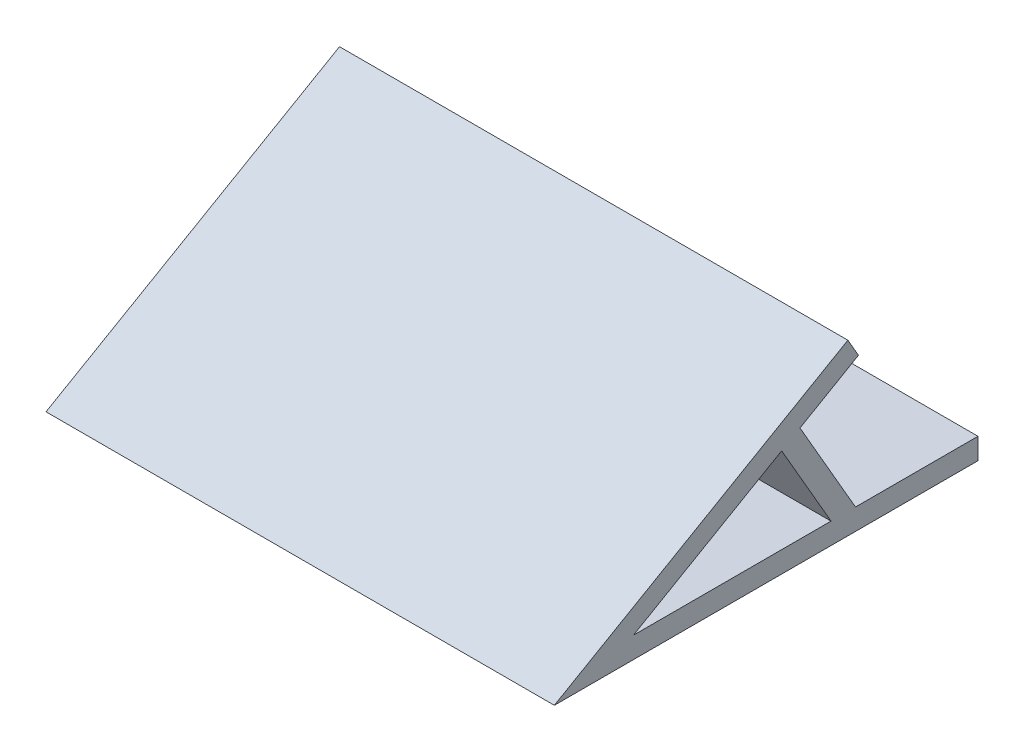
ISO-10303-21;
HEADER;
FILE_DESCRIPTION(('STEP AP214'),'2;1');
FILE_NAME('part.step','',(''),(''),'','','');
FILE_SCHEMA(('AUTOMOTIVE_DESIGN { 1 0 10303 214 1 1 1 1 }'));
ENDSEC;
DATA;
#1=APPLICATION_CONTEXT('core data for automotive mechanical design processes');
#2=APPLICATION_PROTOCOL_DEFINITION('international standard','automotive_design',2000,#1);
#3=PRODUCT_CONTEXT('',#1,'mechanical');
#4=PRODUCT('Part','Part','',(#3));
#5=PRODUCT_RELATED_PRODUCT_CATEGORY('part','',(#4));
#6=PRODUCT_DEFINITION_FORMATION('','',#4);
#7=PRODUCT_DEFINITION_CONTEXT('part definition',#1,'design');
#8=PRODUCT_DEFINITION('design','',#6,#7);
#9=PRODUCT_DEFINITION_SHAPE('','',#8);
#10=(LENGTH_UNIT() NAMED_UNIT(*) SI_UNIT(.MILLI.,.METRE.));
#11=(NAMED_UNIT(*) PLANE_ANGLE_UNIT() SI_UNIT($,.RADIAN.));
#12=(NAMED_UNIT(*) SI_UNIT($,.STERADIAN.) SOLID_ANGLE_UNIT());
#13=UNCERTAINTY_MEASURE_WITH_UNIT(LENGTH_MEASURE(1.E-05),#10,'distance_accuracy_value','');
#14=(GEOMETRIC_REPRESENTATION_CONTEXT(3) GLOBAL_UNCERTAINTY_ASSIGNED_CONTEXT((#13)) GLOBAL_UNIT_ASSIGNED_CONTEXT((#10,
#11,#12)) REPRESENTATION_CONTEXT('',''));
#15=CARTESIAN_POINT('',(0.,0.,0.));
#16=DIRECTION('',(0.,0.,1.));
#17=DIRECTION('',(1.,0.,0.));
#18=AXIS2_PLACEMENT_3D('',#15,#16,#17);
#19=CARTESIAN_POINT('',(60.,15.6314934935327,9.02484697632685));
#20=DIRECTION('',(0.,-0.866025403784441,-0.499999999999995));
#21=DIRECTION('',(0.,0.499999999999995,-0.866025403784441));
#22=AXIS2_PLACEMENT_3D('',#19,#20,#21);
#23=PLANE('',#22);
#24=DIRECTION('',(0.,-0.499999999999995,0.866025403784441));
#25=VECTOR('',#24,1.);
#26=CARTESIAN_POINT('',(0.,15.6314934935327,9.02484697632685));
#27=LINE('',#26,#25);
#28=CARTESIAN_POINT('',(0.,12.600033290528,14.275490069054));
#29=VERTEX_POINT('',#28);
#30=CARTESIAN_POINT('',(0.,2.5,31.7692608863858));
#31=VERTEX_POINT('',#30);
#32=EDGE_CURVE('E125',#29,#31,#27,.T.);
#33=ORIENTED_EDGE('',*,*,#32,.F.);
#34=DIRECTION('',(-1.,0.,0.));
#35=VECTOR('',#34,1.);
#36=CARTESIAN_POINT('',(60.,12.600033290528,14.275490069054));
#37=LINE('',#36,#35);
#38=CARTESIAN_POINT('',(60.,12.600033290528,14.275490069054));
#39=VERTEX_POINT('',#38);
#40=EDGE_CURVE('E11',#39,#29,#37,.T.);
#41=ORIENTED_EDGE('',*,*,#40,.F.);
#42=DIRECTION('',(0.,-0.499999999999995,0.866025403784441));
#43=VECTOR('',#42,1.);
#44=CARTESIAN_POINT('',(60.,15.6314934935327,9.02484697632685));
#45=LINE('',#44,#43);
#46=CARTESIAN_POINT('',(60.,2.5,31.7692608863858));
#47=VERTEX_POINT('',#46);
#48=EDGE_CURVE('E123',#39,#47,#45,.T.);
#49=ORIENTED_EDGE('',*,*,#48,.T.);
#50=DIRECTION('',(-1.,0.,0.));
#51=VECTOR('',#50,1.);
#52=CARTESIAN_POINT('',(60.,2.5,31.7692608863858));
#53=LINE('',#52,#51);
#54=EDGE_CURVE('E59',#47,#31,#53,.T.);
#55=ORIENTED_EDGE('',*,*,#54,.T.);
#56=EDGE_LOOP('',(#33,#41,#49,#55));
#57=FACE_BOUND('',#56,.T.);
#58=ADVANCED_FACE('F39',(#57),#23,.T.);
#59=CARTESIAN_POINT('',(60.,-3.03146020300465,5.25064309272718));
#60=DIRECTION('',(0.,0.499999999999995,-0.866025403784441));
#61=DIRECTION('',(0.,0.866025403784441,0.499999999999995));
#62=AXIS2_PLACEMENT_3D('',#59,#60,#61);
#63=PLANE('',#62);
#64=DIRECTION('',(0.,-0.866025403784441,-0.499999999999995));
#65=VECTOR('',#64,1.);
#66=CARTESIAN_POINT('',(0.,-3.03146020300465,5.25064309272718));
#67=LINE('',#66,#65);
#68=CARTESIAN_POINT('',(0.,2.5,8.44423312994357));
#69=VERTEX_POINT('',#68);
#70=EDGE_CURVE('E177',#29,#69,#67,.T.);
#71=ORIENTED_EDGE('',*,*,#70,.T.);
#72=DIRECTION('',(-1.,0.,0.));
#73=VECTOR('',#72,1.);
#74=CARTESIAN_POINT('',(60.,2.5,8.44423312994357));
#75=LINE('',#74,#73);
#76=CARTESIAN_POINT('',(60.,2.5,8.44423312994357));
#77=VERTEX_POINT('',#76);
#78=EDGE_CURVE('E50',#77,#69,#75,.T.);
#79=ORIENTED_EDGE('',*,*,#78,.F.);
#80=DIRECTION('',(0.,-0.866025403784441,-0.499999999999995));
#81=VECTOR('',#80,1.);
#82=CARTESIAN_POINT('',(60.,-3.03146020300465,5.25064309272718));
#83=LINE('',#82,#81);
#84=EDGE_CURVE('E128',#39,#77,#83,.T.);
#85=ORIENTED_EDGE('',*,*,#84,.F.);
#86=ORIENTED_EDGE('',*,*,#40,.T.);
#87=EDGE_LOOP('',(#71,#79,#85,#86));
#88=FACE_BOUND('',#87,.T.);
#89=ADVANCED_FACE('F129',(#88),#63,.F.);
#90=CARTESIAN_POINT('',(60.,2.5,0.));
#91=DIRECTION('',(0.,1.,0.));
#92=DIRECTION('',(0.,0.,1.));
#93=AXIS2_PLACEMENT_3D('',#90,#91,#92);
#94=PLANE('',#93);
#95=DIRECTION('',(0.,0.,-1.));
#96=VECTOR('',#95,1.);
#97=CARTESIAN_POINT('',(0.,2.5,0.));
#98=LINE('',#97,#96);
#99=CARTESIAN_POINT('',(0.,2.5,5.55748178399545));
#100=VERTEX_POINT('',#99);
#101=CARTESIAN_POINT('',(0.,2.5,-8.90061209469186));
#102=VERTEX_POINT('',#101);
#103=EDGE_CURVE('E147',#100,#102,#98,.T.);
#104=ORIENTED_EDGE('',*,*,#103,.F.);
#105=DIRECTION('',(-1.,0.,0.));
#106=VECTOR('',#105,1.);
#107=CARTESIAN_POINT('',(60.,2.5,5.55748178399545));
#108=LINE('',#107,#106);
#109=CARTESIAN_POINT('',(60.,2.5,5.55748178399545));
#110=VERTEX_POINT('',#109);
#111=EDGE_CURVE('E43',#110,#100,#108,.T.);
#112=ORIENTED_EDGE('',*,*,#111,.F.);
#113=DIRECTION('',(0.,0.,-1.));
#114=VECTOR('',#113,1.);
#115=CARTESIAN_POINT('',(60.,2.5,0.));
#116=LINE('',#115,#114);
#117=CARTESIAN_POINT('',(60.,2.5,-8.90061209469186));
#118=VERTEX_POINT('',#117);
#119=EDGE_CURVE('E184',#110,#118,#116,.T.);
#120=ORIENTED_EDGE('',*,*,#119,.T.);
#121=DIRECTION('',(-1.,0.,0.));
#122=VECTOR('',#121,1.);
#123=CARTESIAN_POINT('',(60.,2.5,-8.90061209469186));
#124=LINE('',#123,#122);
#125=EDGE_CURVE('E146',#118,#102,#124,.T.);
#126=ORIENTED_EDGE('',*,*,#125,.T.);
#127=EDGE_LOOP('',(#104,#112,#120,#126));
#128=FACE_BOUND('',#127,.T.);
#129=ADVANCED_FACE('F41',(#128),#94,.T.);
#130=CARTESIAN_POINT('',(60.,-1.78146020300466,3.08557958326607));
#131=DIRECTION('',(0.,0.499999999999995,-0.866025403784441));
#132=DIRECTION('',(0.,0.866025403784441,0.499999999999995));
#133=AXIS2_PLACEMENT_3D('',#130,#131,#132);
#134=PLANE('',#133);
#135=DIRECTION('',(0.,-0.866025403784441,-0.499999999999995));
#136=VECTOR('',#135,1.);
#137=CARTESIAN_POINT('',(0.,-1.78146020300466,3.08557958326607));
#138=LINE('',#137,#136);
#139=CARTESIAN_POINT('',(0.,13.850033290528,12.1104265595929));
#140=VERTEX_POINT('',#139);
#141=EDGE_CURVE('E151',#140,#100,#138,.T.);
#142=ORIENTED_EDGE('',*,*,#141,.F.);
#143=DIRECTION('',(-1.,0.,0.));
#144=VECTOR('',#143,1.);
#145=CARTESIAN_POINT('',(60.,13.850033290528,12.1104265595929));
#146=LINE('',#145,#144);
#147=CARTESIAN_POINT('',(60.,13.850033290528,12.1104265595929));
#148=VERTEX_POINT('',#147);
#149=EDGE_CURVE('E202',#148,#140,#146,.T.);
#150=ORIENTED_EDGE('',*,*,#149,.F.);
#151=DIRECTION('',(0.,-0.866025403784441,-0.499999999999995));
#152=VECTOR('',#151,1.);
#153=CARTESIAN_POINT('',(60.,-1.78146020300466,3.08557958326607));
#154=LINE('',#153,#152);
#155=EDGE_CURVE('E213',#148,#110,#154,.T.);
#156=ORIENTED_EDGE('',*,*,#155,.T.);
#157=ORIENTED_EDGE('',*,*,#111,.T.);
#158=EDGE_LOOP('',(#142,#150,#156,#157));
#159=FACE_BOUND('',#158,.T.);
#160=ADVANCED_FACE('F211',(#159),#134,.T.);
#161=CARTESIAN_POINT('',(60.,15.6314934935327,9.02484697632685));
#162=DIRECTION('',(0.,-0.866025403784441,-0.499999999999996));
#163=DIRECTION('',(0.,0.499999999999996,-0.866025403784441));
#164=AXIS2_PLACEMENT_3D('',#161,#162,#163);
#165=PLANE('',#164);
#166=DIRECTION('',(0.,-0.499999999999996,0.866025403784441));
#167=VECTOR('',#166,1.);
#168=CARTESIAN_POINT('',(0.,15.6314934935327,9.02484697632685));
#169=LINE('',#168,#167);
#170=CARTESIAN_POINT('',(0.,17.8349364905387,5.2083717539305));
#171=VERTEX_POINT('',#170);
#172=EDGE_CURVE('E155',#171,#140,#169,.T.);
#173=ORIENTED_EDGE('',*,*,#172,.F.);
#174=DIRECTION('',(-1.,0.,0.));
#175=VECTOR('',#174,1.);
#176=CARTESIAN_POINT('',(60.,17.8349364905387,5.2083717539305));
#177=LINE('',#176,#175);
#178=CARTESIAN_POINT('',(60.,17.8349364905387,5.2083717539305));
#179=VERTEX_POINT('',#178);
#180=EDGE_CURVE('E200',#179,#171,#177,.T.);
#181=ORIENTED_EDGE('',*,*,#180,.F.);
#182=DIRECTION('',(0.,-0.499999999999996,0.866025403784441));
#183=VECTOR('',#182,1.);
#184=CARTESIAN_POINT('',(60.,15.6314934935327,9.02484697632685));
#185=LINE('',#184,#183);
#186=EDGE_CURVE('E221',#179,#148,#185,.T.);
#187=ORIENTED_EDGE('',*,*,#186,.T.);
#188=ORIENTED_EDGE('',*,*,#149,.T.);
#189=EDGE_LOOP('',(#173,#181,#187,#188));
#190=FACE_BOUND('',#189,.T.);
#191=ADVANCED_FACE('F219',(#190),#165,.T.);
#192=CARTESIAN_POINT('',(60.,2.20344299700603,-3.81647522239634));
#193=DIRECTION('',(0.,0.499999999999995,-0.866025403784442));
#194=DIRECTION('',(0.,0.866025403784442,0.499999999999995));
#195=AXIS2_PLACEMENT_3D('',#192,#193,#194);
#196=PLANE('',#195);
#197=DIRECTION('',(0.,-0.866025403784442,-0.499999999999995));
#198=VECTOR('',#197,1.);
#199=CARTESIAN_POINT('',(0.,2.20344299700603,-3.81647522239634));
#200=LINE('',#199,#198);
#201=CARTESIAN_POINT('',(0.,19.9999999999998,6.45837175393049));
#202=VERTEX_POINT('',#201);
#203=EDGE_CURVE('E159',#202,#171,#200,.T.);
#204=ORIENTED_EDGE('',*,*,#203,.F.);
#205=DIRECTION('',(-1.,0.,0.));
#206=VECTOR('',#205,1.);
#207=CARTESIAN_POINT('',(60.,19.9999999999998,6.45837175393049));
#208=LINE('',#207,#206);
#209=CARTESIAN_POINT('',(60.,19.9999999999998,6.45837175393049));
#210=VERTEX_POINT('',#209);
#211=EDGE_CURVE('E197',#210,#202,#208,.T.);
#212=ORIENTED_EDGE('',*,*,#211,.F.);
#213=DIRECTION('',(0.,-0.866025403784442,-0.499999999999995));
#214=VECTOR('',#213,1.);
#215=CARTESIAN_POINT('',(60.,2.20344299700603,-3.81647522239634));
#216=LINE('',#215,#214);
#217=EDGE_CURVE('E227',#210,#179,#216,.T.);
#218=ORIENTED_EDGE('',*,*,#217,.T.);
#219=ORIENTED_EDGE('',*,*,#180,.T.);
#220=EDGE_LOOP('',(#204,#212,#218,#219));
#221=FACE_BOUND('',#220,.T.);
#222=ADVANCED_FACE('F231',(#221),#196,.T.);
#223=CARTESIAN_POINT('',(60.,17.7965570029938,10.2748469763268));
#224=DIRECTION('',(0.,0.866025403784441,0.499999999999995));
#225=DIRECTION('',(0.,-0.499999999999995,0.866025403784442));
#226=AXIS2_PLACEMENT_3D('',#223,#224,#225);
#227=PLANE('',#226);
#228=DIRECTION('',(0.,0.499999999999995,-0.866025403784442));
#229=VECTOR('',#228,1.);
#230=CARTESIAN_POINT('',(0.,17.7965570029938,10.2748469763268));
#231=LINE('',#230,#229);
#232=CARTESIAN_POINT('',(0.,0.,41.0993879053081));
#233=VERTEX_POINT('',#232);
#234=EDGE_CURVE('E163',#233,#202,#231,.T.);
#235=ORIENTED_EDGE('',*,*,#234,.F.);
#236=DIRECTION('',(-1.,0.,0.));
#237=VECTOR('',#236,1.);
#238=CARTESIAN_POINT('',(60.,0.,41.0993879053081));
#239=LINE('',#238,#237);
#240=CARTESIAN_POINT('',(60.,0.,41.0993879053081));
#241=VERTEX_POINT('',#240);
#242=EDGE_CURVE('E194',#241,#233,#239,.T.);
#243=ORIENTED_EDGE('',*,*,#242,.F.);
#244=DIRECTION('',(0.,0.499999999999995,-0.866025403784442));
#245=VECTOR('',#244,1.);
#246=CARTESIAN_POINT('',(60.,17.7965570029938,10.2748469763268));
#247=LINE('',#246,#245);
#248=EDGE_CURVE('E233',#241,#210,#247,.T.);
#249=ORIENTED_EDGE('',*,*,#248,.T.);
#250=ORIENTED_EDGE('',*,*,#211,.T.);
#251=EDGE_LOOP('',(#235,#243,#249,#250));
#252=FACE_BOUND('',#251,.T.);
#253=ADVANCED_FACE('F252',(#252),#227,.T.);
#254=CARTESIAN_POINT('',(60.,0.,0.));
#255=DIRECTION('',(0.,-1.,0.));
#256=DIRECTION('',(0.,0.,-1.));
#257=AXIS2_PLACEMENT_3D('',#254,#255,#256);
#258=PLANE('',#257);
#259=DIRECTION('',(0.,0.,1.));
#260=VECTOR('',#259,1.);
#261=CARTESIAN_POINT('',(0.,0.,0.));
#262=LINE('',#261,#260);
#263=CARTESIAN_POINT('',(0.,0.,-8.90061209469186));
#264=VERTEX_POINT('',#263);
#265=EDGE_CURVE('E167',#264,#233,#262,.T.);
#266=ORIENTED_EDGE('',*,*,#265,.F.);
#267=DIRECTION('',(-1.,0.,0.));
#268=VECTOR('',#267,1.);
#269=CARTESIAN_POINT('',(60.,0.,-8.90061209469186));
#270=LINE('',#269,#268);
#271=CARTESIAN_POINT('',(60.,0.,-8.90061209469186));
#272=VERTEX_POINT('',#271);
#273=EDGE_CURVE('E191',#272,#264,#270,.T.);
#274=ORIENTED_EDGE('',*,*,#273,.F.);
#275=DIRECTION('',(0.,0.,1.));
#276=VECTOR('',#275,1.);
#277=CARTESIAN_POINT('',(60.,0.,0.));
#278=LINE('',#277,#276);
#279=EDGE_CURVE('E140',#272,#241,#278,.T.);
#280=ORIENTED_EDGE('',*,*,#279,.T.);
#281=ORIENTED_EDGE('',*,*,#242,.T.);
#282=EDGE_LOOP('',(#266,#274,#280,#281));
#283=FACE_BOUND('',#282,.T.);
#284=ADVANCED_FACE('F243',(#283),#258,.T.);
#285=CARTESIAN_POINT('',(60.,0.,-8.90061209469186));
#286=DIRECTION('',(0.,0.,-1.));
#287=DIRECTION('',(-1.,0.,0.));
#288=AXIS2_PLACEMENT_3D('',#285,#286,#287);
#289=PLANE('',#288);
#290=DIRECTION('',(0.,-1.,0.));
#291=VECTOR('',#290,1.);
#292=CARTESIAN_POINT('',(0.,0.,-8.90061209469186));
#293=LINE('',#292,#291);
#294=EDGE_CURVE('E171',#102,#264,#293,.T.);
#295=ORIENTED_EDGE('',*,*,#294,.F.);
#296=ORIENTED_EDGE('',*,*,#125,.F.);
#297=DIRECTION('',(0.,-1.,0.));
#298=VECTOR('',#297,1.);
#299=CARTESIAN_POINT('',(60.,0.,-8.90061209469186));
#300=LINE('',#299,#298);
#301=EDGE_CURVE('E136',#118,#272,#300,.T.);
#302=ORIENTED_EDGE('',*,*,#301,.T.);
#303=ORIENTED_EDGE('',*,*,#273,.T.);
#304=EDGE_LOOP('',(#295,#296,#302,#303));
#305=FACE_BOUND('',#304,.T.);
#306=ADVANCED_FACE('F247',(#305),#289,.T.);
#307=CARTESIAN_POINT('',(60.,2.5,0.));
#308=DIRECTION('',(0.,1.,0.));
#309=DIRECTION('',(0.,0.,1.));
#310=AXIS2_PLACEMENT_3D('',#307,#308,#309);
#311=PLANE('',#310);
#312=DIRECTION('',(0.,0.,-1.));
#313=VECTOR('',#312,1.);
#314=CARTESIAN_POINT('',(0.,2.5,0.));
#315=LINE('',#314,#313);
#316=EDGE_CURVE('E180',#31,#69,#315,.T.);
#317=ORIENTED_EDGE('',*,*,#316,.F.);
#318=ORIENTED_EDGE('',*,*,#54,.F.);
#319=DIRECTION('',(0.,0.,-1.));
#320=VECTOR('',#319,1.);
#321=CARTESIAN_POINT('',(60.,2.5,0.));
#322=LINE('',#321,#320);
#323=EDGE_CURVE('E132',#47,#77,#322,.T.);
#324=ORIENTED_EDGE('',*,*,#323,.T.);
#325=ORIENTED_EDGE('',*,*,#78,.T.);
#326=EDGE_LOOP('',(#317,#318,#324,#325));
#327=FACE_BOUND('',#326,.T.);
#328=ADVANCED_FACE('F270',(#327),#311,.T.);
#329=CARTESIAN_POINT('',(60.,0.,0.));
#330=DIRECTION('',(1.,0.,0.));
#331=DIRECTION('',(0.,0.,-1.));
#332=AXIS2_PLACEMENT_3D('',#329,#330,#331);
#333=PLANE('',#332);
#334=ORIENTED_EDGE('',*,*,#119,.F.);
#335=ORIENTED_EDGE('',*,*,#155,.F.);
#336=ORIENTED_EDGE('',*,*,#186,.F.);
#337=ORIENTED_EDGE('',*,*,#217,.F.);
#338=ORIENTED_EDGE('',*,*,#248,.F.);
#339=ORIENTED_EDGE('',*,*,#279,.F.);
#340=ORIENTED_EDGE('',*,*,#301,.F.);
#341=EDGE_LOOP('',(#334,#335,#336,#337,#338,#339,#340));
#342=FACE_BOUND('',#341,.T.);
#343=ORIENTED_EDGE('',*,*,#48,.F.);
#344=ORIENTED_EDGE('',*,*,#84,.T.);
#345=ORIENTED_EDGE('',*,*,#323,.F.);
#346=EDGE_LOOP('',(#343,#344,#345));
#347=FACE_BOUND('',#346,.T.);
#348=ADVANCED_FACE('F134',(#342,#347),#333,.T.);
#349=CARTESIAN_POINT('',(0.,0.,0.));
#350=DIRECTION('',(1.,0.,0.));
#351=DIRECTION('',(0.,0.,-1.));
#352=AXIS2_PLACEMENT_3D('',#349,#350,#351);
#353=PLANE('',#352);
#354=ORIENTED_EDGE('',*,*,#103,.T.);
#355=ORIENTED_EDGE('',*,*,#294,.T.);
#356=ORIENTED_EDGE('',*,*,#265,.T.);
#357=ORIENTED_EDGE('',*,*,#234,.T.);
#358=ORIENTED_EDGE('',*,*,#203,.T.);
#359=ORIENTED_EDGE('',*,*,#172,.T.);
#360=ORIENTED_EDGE('',*,*,#141,.T.);
#361=EDGE_LOOP('',(#354,#355,#356,#357,#358,#359,#360));
#362=FACE_BOUND('',#361,.T.);
#363=ORIENTED_EDGE('',*,*,#32,.T.);
#364=ORIENTED_EDGE('',*,*,#316,.T.);
#365=ORIENTED_EDGE('',*,*,#70,.F.);
#366=EDGE_LOOP('',(#363,#364,#365));
#367=FACE_BOUND('',#366,.T.);
#368=ADVANCED_FACE('F216',(#362,#367),#353,.F.);
#369=CLOSED_SHELL('',(#58,#89,#129,#160,#191,#222,#253,#284,#306,#328,#348,#368));
#370=MANIFOLD_SOLID_BREP('B2',#369);
#371=ADVANCED_BREP_SHAPE_REPRESENTATION('',(#18,#370),#14);
#372=SHAPE_DEFINITION_REPRESENTATION(#9,#371);
ENDSEC;
END-ISO-10303-21;
